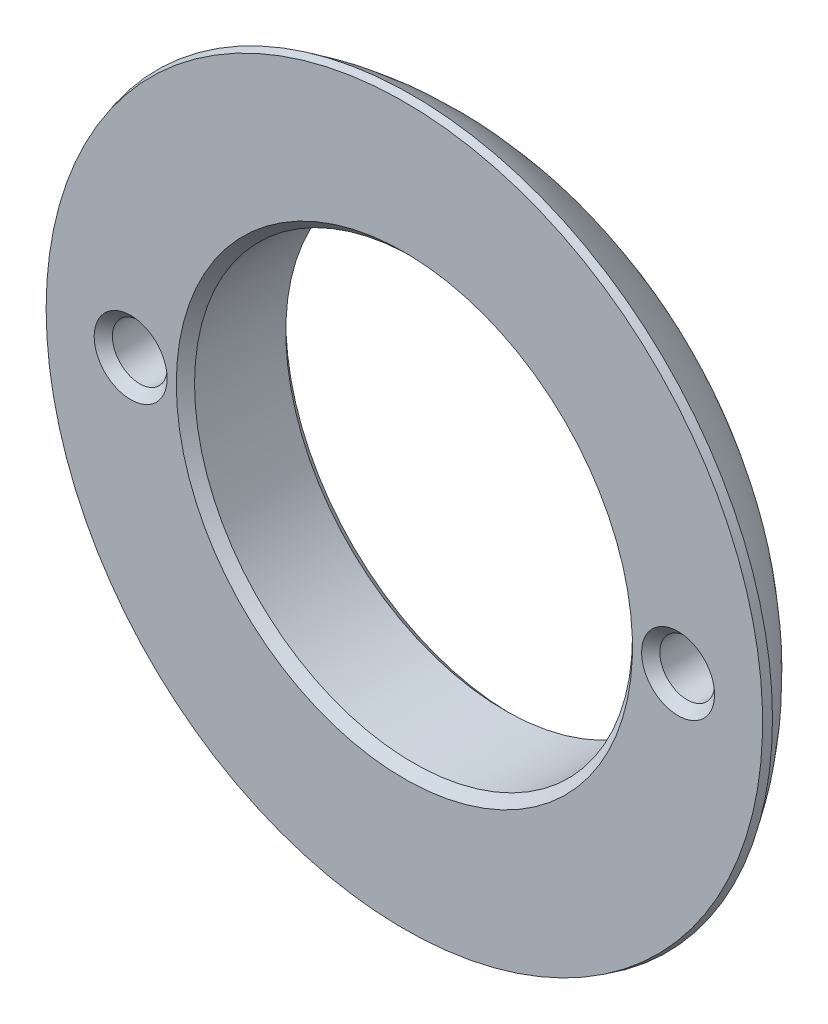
ISO-10303-21;
HEADER;
FILE_DESCRIPTION(('STEP AP214'),'2;1');
FILE_NAME('part.step','',(''),(''),'','','');
FILE_SCHEMA(('AUTOMOTIVE_DESIGN { 1 0 10303 214 1 1 1 1 }'));
ENDSEC;
DATA;
#1=APPLICATION_CONTEXT('core data for automotive mechanical design processes');
#2=APPLICATION_PROTOCOL_DEFINITION('international standard','automotive_design',2000,#1);
#3=PRODUCT_CONTEXT('',#1,'mechanical');
#4=PRODUCT('Part','Part','',(#3));
#5=PRODUCT_RELATED_PRODUCT_CATEGORY('part','',(#4));
#6=PRODUCT_DEFINITION_FORMATION('','',#4);
#7=PRODUCT_DEFINITION_CONTEXT('part definition',#1,'design');
#8=PRODUCT_DEFINITION('design','',#6,#7);
#9=PRODUCT_DEFINITION_SHAPE('','',#8);
#10=(LENGTH_UNIT() NAMED_UNIT(*) SI_UNIT(.MILLI.,.METRE.));
#11=(NAMED_UNIT(*) PLANE_ANGLE_UNIT() SI_UNIT($,.RADIAN.));
#12=(NAMED_UNIT(*) SI_UNIT($,.STERADIAN.) SOLID_ANGLE_UNIT());
#13=UNCERTAINTY_MEASURE_WITH_UNIT(LENGTH_MEASURE(1.E-05),#10,'distance_accuracy_value','');
#14=(GEOMETRIC_REPRESENTATION_CONTEXT(3) GLOBAL_UNCERTAINTY_ASSIGNED_CONTEXT((#13)) GLOBAL_UNIT_ASSIGNED_CONTEXT((#10,
#11,#12)) REPRESENTATION_CONTEXT('',''));
#15=CARTESIAN_POINT('',(0.,0.,0.));
#16=DIRECTION('',(0.,0.,1.));
#17=DIRECTION('',(1.,0.,0.));
#18=AXIS2_PLACEMENT_3D('',#15,#16,#17);
#19=CARTESIAN_POINT('',(0.,6.,-1.5));
#20=DIRECTION('',(0.,0.,1.));
#21=DIRECTION('',(1.,0.,0.));
#22=AXIS2_PLACEMENT_3D('',#19,#20,#21);
#23=PLANE('',#22);
#24=CARTESIAN_POINT('',(0.,0.,-1.5));
#25=DIRECTION('',(0.,0.,1.));
#26=DIRECTION('',(1.,0.,0.));
#27=AXIS2_PLACEMENT_3D('',#24,#25,#26);
#28=CIRCLE('',#27,6.24999999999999);
#29=CARTESIAN_POINT('',(6.24999999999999,0.,-1.5));
#30=VERTEX_POINT('',#29);
#31=EDGE_CURVE('E36',#30,#30,#28,.T.);
#32=ORIENTED_EDGE('',*,*,#31,.T.);
#33=EDGE_LOOP('',(#32));
#34=FACE_BOUND('',#33,.T.);
#35=CARTESIAN_POINT('',(0.,0.,-1.5));
#36=DIRECTION('',(0.,0.,1.));
#37=DIRECTION('',(1.,0.,0.));
#38=AXIS2_PLACEMENT_3D('',#35,#36,#37);
#39=CIRCLE('',#38,6.46712750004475);
#40=CARTESIAN_POINT('',(6.46712750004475,0.,-1.5));
#41=VERTEX_POINT('',#40);
#42=EDGE_CURVE('E79',#41,#41,#39,.T.);
#43=ORIENTED_EDGE('',*,*,#42,.F.);
#44=EDGE_LOOP('',(#43));
#45=FACE_BOUND('',#44,.T.);
#46=ADVANCED_FACE('F29',(#34,#45),#23,.F.);
#47=CARTESIAN_POINT('',(0.,0.,4.8));
#48=DIRECTION('',(0.,0.,1.));
#49=DIRECTION('',(1.,0.,0.));
#50=AXIS2_PLACEMENT_3D('',#47,#48,#49);
#51=DEGENERATE_TOROIDAL_SURFACE('',#50,4.15756044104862,6.71,.T.);
#52=CARTESIAN_POINT('',(0.,0.,1.28844495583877));
#53=DIRECTION('',(0.,0.,1.));
#54=DIRECTION('',(1.,0.,0.));
#55=AXIS2_PLACEMENT_3D('',#52,#53,#54);
#56=CIRCLE('',#55,9.87534682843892);
#57=CARTESIAN_POINT('',(9.87534682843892,0.,1.28844495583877));
#58=VERTEX_POINT('',#57);
#59=EDGE_CURVE('E10',#58,#58,#56,.F.);
#60=ORIENTED_EDGE('',*,*,#59,.T.);
#61=EDGE_LOOP('',(#60));
#62=FACE_BOUND('',#61,.T.);
#63=ORIENTED_EDGE('',*,*,#42,.T.);
#64=EDGE_LOOP('',(#63));
#65=FACE_BOUND('',#64,.T.);
#66=ADVANCED_FACE('F83',(#62,#65),#51,.T.);
#67=CARTESIAN_POINT('',(0.,6.,1.5));
#68=DIRECTION('',(0.,0.,-1.));
#69=DIRECTION('',(-1.,0.,0.));
#70=AXIS2_PLACEMENT_3D('',#67,#68,#69);
#71=PLANE('',#70);
#72=CARTESIAN_POINT('',(7.5,0.,1.5));
#73=DIRECTION('',(0.,0.,-1.));
#74=DIRECTION('',(-1.,0.,0.));
#75=AXIS2_PLACEMENT_3D('',#72,#73,#74);
#76=CIRCLE('',#75,1.);
#77=CARTESIAN_POINT('',(6.5,0.,1.5));
#78=VERTEX_POINT('',#77);
#79=EDGE_CURVE('E61',#78,#78,#76,.T.);
#80=ORIENTED_EDGE('',*,*,#79,.T.);
#81=EDGE_LOOP('',(#80));
#82=FACE_BOUND('',#81,.T.);
#83=CARTESIAN_POINT('',(-7.5,0.,1.5));
#84=DIRECTION('',(0.,0.,-1.));
#85=DIRECTION('',(-1.,0.,0.));
#86=AXIS2_PLACEMENT_3D('',#83,#84,#85);
#87=CIRCLE('',#86,1.);
#88=CARTESIAN_POINT('',(-8.5,0.,1.5));
#89=VERTEX_POINT('',#88);
#90=EDGE_CURVE('E64',#89,#89,#87,.T.);
#91=ORIENTED_EDGE('',*,*,#90,.T.);
#92=EDGE_LOOP('',(#91));
#93=FACE_BOUND('',#92,.T.);
#94=CARTESIAN_POINT('',(0.,0.,1.5));
#95=DIRECTION('',(0.,0.,-1.));
#96=DIRECTION('',(-1.,0.,0.));
#97=AXIS2_PLACEMENT_3D('',#94,#95,#96);
#98=CIRCLE('',#97,6.25);
#99=CARTESIAN_POINT('',(-6.25,0.,1.5));
#100=VERTEX_POINT('',#99);
#101=EDGE_CURVE('E67',#100,#100,#98,.T.);
#102=ORIENTED_EDGE('',*,*,#101,.T.);
#103=EDGE_LOOP('',(#102));
#104=FACE_BOUND('',#103,.T.);
#105=CARTESIAN_POINT('',(0.,0.,1.5));
#106=DIRECTION('',(0.,0.,-1.));
#107=DIRECTION('',(-1.,0.,0.));
#108=AXIS2_PLACEMENT_3D('',#105,#106,#107);
#109=CIRCLE('',#108,9.81651505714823);
#110=CARTESIAN_POINT('',(-9.81651505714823,0.,1.5));
#111=VERTEX_POINT('',#110);
#112=EDGE_CURVE('E70',#111,#111,#109,.F.);
#113=ORIENTED_EDGE('',*,*,#112,.T.);
#114=EDGE_LOOP('',(#113));
#115=FACE_BOUND('',#114,.T.);
#116=ADVANCED_FACE('F90',(#82,#93,#104,#115),#71,.F.);
#117=CARTESIAN_POINT('',(0.,0.,1.5));
#118=DIRECTION('',(0.,0.,1.));
#119=DIRECTION('',(1.,0.,0.));
#120=AXIS2_PLACEMENT_3D('',#117,#118,#119);
#121=CYLINDRICAL_SURFACE('',#120,6.);
#122=CARTESIAN_POINT('',(0.,0.,1.25));
#123=DIRECTION('',(0.,0.,-1.));
#124=DIRECTION('',(-1.,0.,0.));
#125=AXIS2_PLACEMENT_3D('',#122,#123,#124);
#126=CIRCLE('',#125,6.);
#127=CARTESIAN_POINT('',(-6.,0.,1.25));
#128=VERTEX_POINT('',#127);
#129=EDGE_CURVE('E40',#128,#128,#126,.F.);
#130=ORIENTED_EDGE('',*,*,#129,.T.);
#131=EDGE_LOOP('',(#130));
#132=FACE_BOUND('',#131,.T.);
#133=CARTESIAN_POINT('',(0.,0.,-1.25000000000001));
#134=DIRECTION('',(0.,0.,1.));
#135=DIRECTION('',(1.,0.,0.));
#136=AXIS2_PLACEMENT_3D('',#133,#134,#135);
#137=CIRCLE('',#136,6.);
#138=CARTESIAN_POINT('',(6.,0.,-1.25000000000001));
#139=VERTEX_POINT('',#138);
#140=EDGE_CURVE('E44',#139,#139,#137,.F.);
#141=ORIENTED_EDGE('',*,*,#140,.T.);
#142=EDGE_LOOP('',(#141));
#143=FACE_BOUND('',#142,.T.);
#144=ADVANCED_FACE('F124',(#132,#143),#121,.F.);
#145=CARTESIAN_POINT('',(-7.5,0.,0.));
#146=DIRECTION('',(0.,0.,1.));
#147=DIRECTION('',(1.,0.,0.));
#148=AXIS2_PLACEMENT_3D('',#145,#146,#147);
#149=CYLINDRICAL_SURFACE('',#148,0.75);
#150=CARTESIAN_POINT('',(-7.5,0.,1.25));
#151=DIRECTION('',(0.,0.,-1.));
#152=DIRECTION('',(-1.,0.,0.));
#153=AXIS2_PLACEMENT_3D('',#150,#151,#152);
#154=CIRCLE('',#153,0.75);
#155=CARTESIAN_POINT('',(-8.25,0.,1.25));
#156=VERTEX_POINT('',#155);
#157=EDGE_CURVE('E52',#156,#156,#154,.F.);
#158=ORIENTED_EDGE('',*,*,#157,.T.);
#159=EDGE_LOOP('',(#158));
#160=FACE_BOUND('',#159,.T.);
#161=CARTESIAN_POINT('',(-7.5,0.,0.249999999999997));
#162=DIRECTION('',(0.,0.,1.));
#163=DIRECTION('',(1.,0.,0.));
#164=AXIS2_PLACEMENT_3D('',#161,#162,#163);
#165=CIRCLE('',#164,0.75);
#166=CARTESIAN_POINT('',(-6.75,0.,0.249999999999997));
#167=VERTEX_POINT('',#166);
#168=EDGE_CURVE('E55',#167,#167,#165,.F.);
#169=ORIENTED_EDGE('',*,*,#168,.T.);
#170=EDGE_LOOP('',(#169));
#171=FACE_BOUND('',#170,.T.);
#172=ADVANCED_FACE('F126',(#160,#171),#149,.F.);
#173=CARTESIAN_POINT('',(-7.5,0.,0.));
#174=DIRECTION('',(0.,0.,1.));
#175=DIRECTION('',(1.,0.,0.));
#176=AXIS2_PLACEMENT_3D('',#173,#174,#175);
#177=PLANE('',#176);
#178=CARTESIAN_POINT('',(-7.5,0.,0.));
#179=DIRECTION('',(0.,0.,1.));
#180=DIRECTION('',(1.,0.,0.));
#181=AXIS2_PLACEMENT_3D('',#178,#179,#180);
#182=CIRCLE('',#181,0.5);
#183=CARTESIAN_POINT('',(-7.,0.,0.));
#184=VERTEX_POINT('',#183);
#185=EDGE_CURVE('E49',#184,#184,#182,.T.);
#186=ORIENTED_EDGE('',*,*,#185,.T.);
#187=EDGE_LOOP('',(#186));
#188=FACE_BOUND('',#187,.T.);
#189=ADVANCED_FACE('F133',(#188),#177,.T.);
#190=CARTESIAN_POINT('',(7.5,0.,0.));
#191=DIRECTION('',(0.,0.,1.));
#192=DIRECTION('',(1.,0.,0.));
#193=AXIS2_PLACEMENT_3D('',#190,#191,#192);
#194=CYLINDRICAL_SURFACE('',#193,0.75);
#195=CARTESIAN_POINT('',(7.5,0.,1.25));
#196=DIRECTION('',(0.,0.,-1.));
#197=DIRECTION('',(-1.,0.,0.));
#198=AXIS2_PLACEMENT_3D('',#195,#196,#197);
#199=CIRCLE('',#198,0.75);
#200=CARTESIAN_POINT('',(6.75,0.,1.25));
#201=VERTEX_POINT('',#200);
#202=EDGE_CURVE('E73',#201,#201,#199,.F.);
#203=ORIENTED_EDGE('',*,*,#202,.T.);
#204=EDGE_LOOP('',(#203));
#205=FACE_BOUND('',#204,.T.);
#206=CARTESIAN_POINT('',(7.5,0.,0.250000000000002));
#207=DIRECTION('',(0.,0.,1.));
#208=DIRECTION('',(1.,0.,0.));
#209=AXIS2_PLACEMENT_3D('',#206,#207,#208);
#210=CIRCLE('',#209,0.75);
#211=CARTESIAN_POINT('',(8.25,0.,0.250000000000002));
#212=VERTEX_POINT('',#211);
#213=EDGE_CURVE('E76',#212,#212,#210,.F.);
#214=ORIENTED_EDGE('',*,*,#213,.T.);
#215=EDGE_LOOP('',(#214));
#216=FACE_BOUND('',#215,.T.);
#217=ADVANCED_FACE('F140',(#205,#216),#194,.F.);
#218=CARTESIAN_POINT('',(7.5,0.,0.));
#219=DIRECTION('',(0.,0.,1.));
#220=DIRECTION('',(1.,0.,0.));
#221=AXIS2_PLACEMENT_3D('',#218,#219,#220);
#222=PLANE('',#221);
#223=CARTESIAN_POINT('',(7.5,0.,0.));
#224=DIRECTION('',(0.,0.,1.));
#225=DIRECTION('',(1.,0.,0.));
#226=AXIS2_PLACEMENT_3D('',#223,#224,#225);
#227=CIRCLE('',#226,0.499999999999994);
#228=CARTESIAN_POINT('',(7.99999999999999,0.,0.));
#229=VERTEX_POINT('',#228);
#230=EDGE_CURVE('E58',#229,#229,#227,.T.);
#231=ORIENTED_EDGE('',*,*,#230,.T.);
#232=EDGE_LOOP('',(#231));
#233=FACE_BOUND('',#232,.T.);
#234=ADVANCED_FACE('F98',(#233),#222,.T.);
#235=CARTESIAN_POINT('',(7.5,0.,1.25));
#236=DIRECTION('',(0.,0.,1.));
#237=DIRECTION('',(1.,0.,0.));
#238=AXIS2_PLACEMENT_3D('',#235,#236,#237);
#239=CONICAL_SURFACE('',#238,0.75,0.785398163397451);
#240=ORIENTED_EDGE('',*,*,#79,.F.);
#241=EDGE_LOOP('',(#240));
#242=FACE_BOUND('',#241,.T.);
#243=ORIENTED_EDGE('',*,*,#202,.F.);
#244=EDGE_LOOP('',(#243));
#245=FACE_BOUND('',#244,.T.);
#246=ADVANCED_FACE('F94',(#242,#245),#239,.F.);
#247=CARTESIAN_POINT('',(7.5,0.,0.));
#248=DIRECTION('',(0.,0.,1.));
#249=DIRECTION('',(1.,0.,0.));
#250=AXIS2_PLACEMENT_3D('',#247,#248,#249);
#251=CONICAL_SURFACE('',#250,0.499999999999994,0.785398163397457);
#252=ORIENTED_EDGE('',*,*,#213,.F.);
#253=EDGE_LOOP('',(#252));
#254=FACE_BOUND('',#253,.T.);
#255=ORIENTED_EDGE('',*,*,#230,.F.);
#256=EDGE_LOOP('',(#255));
#257=FACE_BOUND('',#256,.T.);
#258=ADVANCED_FACE('F97',(#254,#257),#251,.F.);
#259=CARTESIAN_POINT('',(-7.5,0.,1.25));
#260=DIRECTION('',(0.,0.,1.));
#261=DIRECTION('',(1.,0.,0.));
#262=AXIS2_PLACEMENT_3D('',#259,#260,#261);
#263=CONICAL_SURFACE('',#262,0.75,0.785398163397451);
#264=ORIENTED_EDGE('',*,*,#90,.F.);
#265=EDGE_LOOP('',(#264));
#266=FACE_BOUND('',#265,.T.);
#267=ORIENTED_EDGE('',*,*,#157,.F.);
#268=EDGE_LOOP('',(#267));
#269=FACE_BOUND('',#268,.T.);
#270=ADVANCED_FACE('F102',(#266,#269),#263,.F.);
#271=CARTESIAN_POINT('',(-7.5,0.,0.));
#272=DIRECTION('',(0.,0.,1.));
#273=DIRECTION('',(1.,0.,0.));
#274=AXIS2_PLACEMENT_3D('',#271,#272,#273);
#275=CONICAL_SURFACE('',#274,0.5,0.785398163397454);
#276=ORIENTED_EDGE('',*,*,#168,.F.);
#277=EDGE_LOOP('',(#276));
#278=FACE_BOUND('',#277,.T.);
#279=ORIENTED_EDGE('',*,*,#185,.F.);
#280=EDGE_LOOP('',(#279));
#281=FACE_BOUND('',#280,.T.);
#282=ADVANCED_FACE('F106',(#278,#281),#275,.F.);
#283=CARTESIAN_POINT('',(0.,0.,1.25));
#284=DIRECTION('',(0.,0.,1.));
#285=DIRECTION('',(1.,0.,0.));
#286=AXIS2_PLACEMENT_3D('',#283,#284,#285);
#287=CONICAL_SURFACE('',#286,6.,0.785398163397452);
#288=ORIENTED_EDGE('',*,*,#101,.F.);
#289=EDGE_LOOP('',(#288));
#290=FACE_BOUND('',#289,.T.);
#291=ORIENTED_EDGE('',*,*,#129,.F.);
#292=EDGE_LOOP('',(#291));
#293=FACE_BOUND('',#292,.T.);
#294=ADVANCED_FACE('F110',(#290,#293),#287,.F.);
#295=CARTESIAN_POINT('',(0.,0.,-1.5));
#296=DIRECTION('',(0.,0.,-1.));
#297=DIRECTION('',(-1.,0.,0.));
#298=AXIS2_PLACEMENT_3D('',#295,#296,#297);
#299=CONICAL_SURFACE('',#298,6.24999999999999,0.785398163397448);
#300=ORIENTED_EDGE('',*,*,#140,.F.);
#301=EDGE_LOOP('',(#300));
#302=FACE_BOUND('',#301,.T.);
#303=ORIENTED_EDGE('',*,*,#31,.F.);
#304=EDGE_LOOP('',(#303));
#305=FACE_BOUND('',#304,.T.);
#306=ADVANCED_FACE('F113',(#302,#305),#299,.F.);
#307=CARTESIAN_POINT('',(0.,0.,1.5));
#308=DIRECTION('',(0.,0.,-1.));
#309=DIRECTION('',(-1.,0.,0.));
#310=AXIS2_PLACEMENT_3D('',#307,#308,#309);
#311=CONICAL_SURFACE('',#310,9.81651505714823,0.27123856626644);
#312=ORIENTED_EDGE('',*,*,#59,.F.);
#313=EDGE_LOOP('',(#312));
#314=FACE_BOUND('',#313,.T.);
#315=ORIENTED_EDGE('',*,*,#112,.F.);
#316=EDGE_LOOP('',(#315));
#317=FACE_BOUND('',#316,.T.);
#318=ADVANCED_FACE('F31',(#314,#317),#311,.T.);
#319=CLOSED_SHELL('',(#46,#66,#116,#144,#172,#189,#217,#234,#246,#258,#270,#282,#294,#306,#318));
#320=MANIFOLD_SOLID_BREP('B2',#319);
#321=ADVANCED_BREP_SHAPE_REPRESENTATION('',(#18,#320),#14);
#322=SHAPE_DEFINITION_REPRESENTATION(#9,#321);
ENDSEC;
END-ISO-10303-21;
